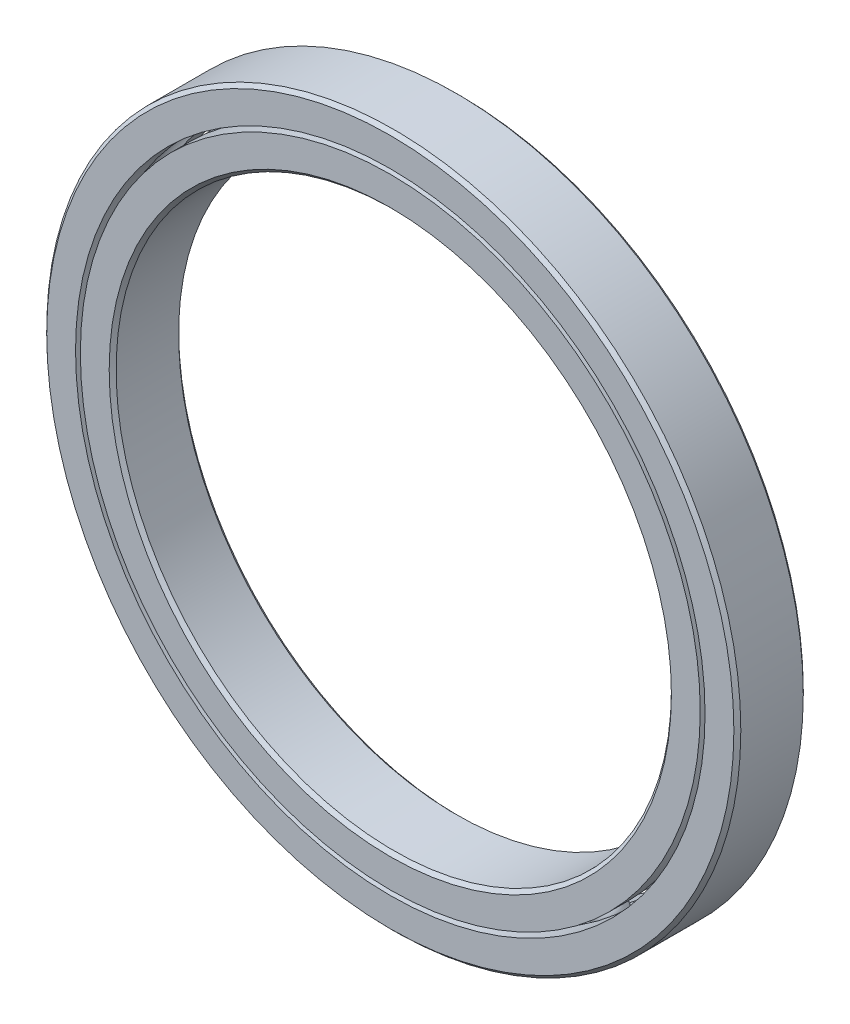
ISO-10303-21;
HEADER;
FILE_DESCRIPTION(('STEP AP214'),'2;1');
FILE_NAME('part.step','',(''),(''),'','','');
FILE_SCHEMA(('AUTOMOTIVE_DESIGN { 1 0 10303 214 1 1 1 1 }'));
ENDSEC;
DATA;
#1=APPLICATION_CONTEXT('core data for automotive mechanical design processes');
#2=APPLICATION_PROTOCOL_DEFINITION('international standard','automotive_design',2000,#1);
#3=PRODUCT_CONTEXT('',#1,'mechanical');
#4=PRODUCT('Part','Part','',(#3));
#5=PRODUCT_RELATED_PRODUCT_CATEGORY('part','',(#4));
#6=PRODUCT_DEFINITION_FORMATION('','',#4);
#7=PRODUCT_DEFINITION_CONTEXT('part definition',#1,'design');
#8=PRODUCT_DEFINITION('design','',#6,#7);
#9=PRODUCT_DEFINITION_SHAPE('','',#8);
#10=(LENGTH_UNIT() NAMED_UNIT(*) SI_UNIT(.MILLI.,.METRE.));
#11=(NAMED_UNIT(*) PLANE_ANGLE_UNIT() SI_UNIT($,.RADIAN.));
#12=(NAMED_UNIT(*) SI_UNIT($,.STERADIAN.) SOLID_ANGLE_UNIT());
#13=UNCERTAINTY_MEASURE_WITH_UNIT(LENGTH_MEASURE(1.E-05),#10,'distance_accuracy_value','');
#14=(GEOMETRIC_REPRESENTATION_CONTEXT(3) GLOBAL_UNCERTAINTY_ASSIGNED_CONTEXT((#13)) GLOBAL_UNIT_ASSIGNED_CONTEXT((#10,
#11,#12)) REPRESENTATION_CONTEXT('',''));
#15=CARTESIAN_POINT('',(0.,0.,0.));
#16=DIRECTION('',(0.,0.,1.));
#17=DIRECTION('',(1.,0.,0.));
#18=AXIS2_PLACEMENT_3D('',#15,#16,#17);
#19=CARTESIAN_POINT('',(-16.7959635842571,23.1176606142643,0.));
#20=DIRECTION('',(0.,0.,1.));
#21=DIRECTION('',(-0.587785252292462,0.809016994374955,0.));
#22=AXIS2_PLACEMENT_3D('',#19,#20,#21);
#23=SPHERICAL_SURFACE('',#22,1.42812814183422);
#24=CARTESIAN_POINT('',(-16.7959635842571,23.1176606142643,1.42812814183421));
#25=VERTEX_POINT('',#24);
#26=VERTEX_LOOP('',#25);
#27=FACE_BOUND('',#26,.T.);
#28=ADVANCED_FACE('F41',(#27),#23,.T.);
#29=CLOSED_SHELL('',(#28));
#30=MANIFOLD_SOLID_BREP('B2',#29);
#31=CARTESIAN_POINT('',(-27.1764399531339,8.83016061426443,0.));
#32=DIRECTION('',(0.,0.,1.));
#33=DIRECTION('',(-0.95105651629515,0.309016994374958,0.));
#34=AXIS2_PLACEMENT_3D('',#31,#32,#33);
#35=SPHERICAL_SURFACE('',#34,1.42812814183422);
#36=CARTESIAN_POINT('',(-27.1764399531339,8.83016061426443,1.42812814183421));
#37=VERTEX_POINT('',#36);
#38=VERTEX_LOOP('',#37);
#39=FACE_BOUND('',#38,.T.);
#40=ADVANCED_FACE('F61',(#39),#35,.T.);
#41=CLOSED_SHELL('',(#40));
#42=MANIFOLD_SOLID_BREP('B6',#41);
#43=CARTESIAN_POINT('',(-27.1764399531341,-8.83016061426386,0.));
#44=DIRECTION('',(0.,0.,1.));
#45=DIRECTION('',(-0.951056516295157,-0.309016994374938,0.));
#46=AXIS2_PLACEMENT_3D('',#43,#44,#45);
#47=SPHERICAL_SURFACE('',#46,1.42812814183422);
#48=CARTESIAN_POINT('',(-27.1764399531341,-8.83016061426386,1.42812814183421));
#49=VERTEX_POINT('',#48);
#50=VERTEX_LOOP('',#49);
#51=FACE_BOUND('',#50,.T.);
#52=ADVANCED_FACE('F81',(#51),#47,.T.);
#53=CLOSED_SHELL('',(#52));
#54=MANIFOLD_SOLID_BREP('B37',#53);
#55=CARTESIAN_POINT('',(-16.7959635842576,-23.117660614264,0.));
#56=DIRECTION('',(0.,0.,1.));
#57=DIRECTION('',(-0.58778525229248,-0.809016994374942,0.));
#58=AXIS2_PLACEMENT_3D('',#55,#56,#57);
#59=SPHERICAL_SURFACE('',#58,1.42812814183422);
#60=CARTESIAN_POINT('',(-16.7959635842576,-23.117660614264,1.42812814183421));
#61=VERTEX_POINT('',#60);
#62=VERTEX_LOOP('',#61);
#63=FACE_BOUND('',#62,.T.);
#64=ADVANCED_FACE('F101',(#63),#59,.T.);
#65=CLOSED_SHELL('',(#64));
#66=MANIFOLD_SOLID_BREP('B57',#65);
#67=CARTESIAN_POINT('',(-1.99538274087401E-13,-28.575,0.));
#68=DIRECTION('',(0.,0.,1.));
#69=DIRECTION('',(0.,-1.,0.));
#70=AXIS2_PLACEMENT_3D('',#67,#68,#69);
#71=SPHERICAL_SURFACE('',#70,1.42812814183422);
#72=CARTESIAN_POINT('',(-1.99538274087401E-13,-28.575,1.42812814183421));
#73=VERTEX_POINT('',#72);
#74=VERTEX_LOOP('',#73);
#75=FACE_BOUND('',#74,.T.);
#76=ADVANCED_FACE('F121',(#75),#71,.T.);
#77=CLOSED_SHELL('',(#76));
#78=MANIFOLD_SOLID_BREP('B77',#77);
#79=CARTESIAN_POINT('',(16.7959635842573,-23.1176606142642,0.));
#80=DIRECTION('',(0.,0.,1.));
#81=DIRECTION('',(0.587785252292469,-0.809016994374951,0.));
#82=AXIS2_PLACEMENT_3D('',#79,#80,#81);
#83=SPHERICAL_SURFACE('',#82,1.42812814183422);
#84=CARTESIAN_POINT('',(16.7959635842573,-23.1176606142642,1.42812814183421));
#85=VERTEX_POINT('',#84);
#86=VERTEX_LOOP('',#85);
#87=FACE_BOUND('',#86,.T.);
#88=ADVANCED_FACE('F141',(#87),#83,.T.);
#89=CLOSED_SHELL('',(#88));
#90=MANIFOLD_SOLID_BREP('B97',#89);
#91=CARTESIAN_POINT('',(27.176439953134,-8.83016061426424,0.));
#92=DIRECTION('',(0.,0.,1.));
#93=DIRECTION('',(0.951056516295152,-0.309016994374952,0.));
#94=AXIS2_PLACEMENT_3D('',#91,#92,#93);
#95=SPHERICAL_SURFACE('',#94,1.42812814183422);
#96=CARTESIAN_POINT('',(27.176439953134,-8.83016061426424,1.42812814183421));
#97=VERTEX_POINT('',#96);
#98=VERTEX_LOOP('',#97);
#99=FACE_BOUND('',#98,.T.);
#100=ADVANCED_FACE('F161',(#99),#95,.T.);
#101=CLOSED_SHELL('',(#100));
#102=MANIFOLD_SOLID_BREP('B117',#101);
#103=CARTESIAN_POINT('',(27.176439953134,8.83016061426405,0.));
#104=DIRECTION('',(0.,0.,1.));
#105=DIRECTION('',(0.951056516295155,0.309016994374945,0.));
#106=AXIS2_PLACEMENT_3D('',#103,#104,#105);
#107=SPHERICAL_SURFACE('',#106,1.42812814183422);
#108=CARTESIAN_POINT('',(27.176439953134,8.83016061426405,1.42812814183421));
#109=VERTEX_POINT('',#108);
#110=VERTEX_LOOP('',#109);
#111=FACE_BOUND('',#110,.T.);
#112=ADVANCED_FACE('F181',(#111),#107,.T.);
#113=CLOSED_SHELL('',(#112));
#114=MANIFOLD_SOLID_BREP('B137',#113);
#115=CARTESIAN_POINT('',(16.7959635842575,23.1176606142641,0.));
#116=DIRECTION('',(0.,0.,1.));
#117=DIRECTION('',(0.587785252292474,0.809016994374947,0.));
#118=AXIS2_PLACEMENT_3D('',#115,#116,#117);
#119=SPHERICAL_SURFACE('',#118,1.42812814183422);
#120=CARTESIAN_POINT('',(16.7959635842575,23.1176606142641,1.42812814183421));
#121=VERTEX_POINT('',#120);
#122=VERTEX_LOOP('',#121);
#123=FACE_BOUND('',#122,.T.);
#124=ADVANCED_FACE('F201',(#123),#119,.T.);
#125=CLOSED_SHELL('',(#124));
#126=MANIFOLD_SOLID_BREP('B157',#125);
#127=CARTESIAN_POINT('',(0.,28.575,0.));
#128=DIRECTION('',(0.,0.,1.));
#129=DIRECTION('',(0.,1.,0.));
#130=AXIS2_PLACEMENT_3D('',#127,#128,#129);
#131=SPHERICAL_SURFACE('',#130,1.42812814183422);
#132=CARTESIAN_POINT('',(0.,28.575,1.42812814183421));
#133=VERTEX_POINT('',#132);
#134=VERTEX_LOOP('',#133);
#135=FACE_BOUND('',#134,.T.);
#136=ADVANCED_FACE('F223',(#135),#131,.T.);
#137=CLOSED_SHELL('',(#136));
#138=MANIFOLD_SOLID_BREP('B177',#137);
#139=CARTESIAN_POINT('',(0.,28.3551923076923,3.17500000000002));
#140=DIRECTION('',(0.,0.,-1.));
#141=DIRECTION('',(-1.,0.,0.));
#142=AXIS2_PLACEMENT_3D('',#139,#140,#141);
#143=PLANE('',#142);
#144=CARTESIAN_POINT('',(0.,0.,3.17500000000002));
#145=DIRECTION('',(0.,0.,1.));
#146=DIRECTION('',(1.,0.,0.));
#147=AXIS2_PLACEMENT_3D('',#144,#145,#146);
#148=CIRCLE('',#147,25.7175);
#149=CARTESIAN_POINT('',(25.7175,0.,3.17500000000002));
#150=VERTEX_POINT('',#149);
#151=EDGE_CURVE('E278',#150,#150,#148,.T.);
#152=ORIENTED_EDGE('',*,*,#151,.F.);
#153=EDGE_LOOP('',(#152));
#154=FACE_BOUND('',#153,.T.);
#155=CARTESIAN_POINT('',(0.,0.,3.17500000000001));
#156=DIRECTION('',(0.,0.,1.));
#157=DIRECTION('',(1.,0.,0.));
#158=AXIS2_PLACEMENT_3D('',#155,#156,#157);
#159=CIRCLE('',#158,28.3551923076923);
#160=CARTESIAN_POINT('',(28.3551923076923,0.,3.17500000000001));
#161=VERTEX_POINT('',#160);
#162=EDGE_CURVE('E222',#161,#161,#159,.T.);
#163=ORIENTED_EDGE('',*,*,#162,.T.);
#164=EDGE_LOOP('',(#163));
#165=FACE_BOUND('',#164,.T.);
#166=ADVANCED_FACE('F242',(#154,#165),#143,.F.);
#167=CARTESIAN_POINT('',(0.,0.,3.175));
#168=DIRECTION('',(0.,0.,1.));
#169=DIRECTION('',(1.,0.,0.));
#170=AXIS2_PLACEMENT_3D('',#167,#168,#169);
#171=CYLINDRICAL_SURFACE('',#170,28.3551923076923);
#172=ORIENTED_EDGE('',*,*,#162,.F.);
#173=EDGE_LOOP('',(#172));
#174=FACE_BOUND('',#173,.T.);
#175=CARTESIAN_POINT('',(0.,0.,1.4111111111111));
#176=DIRECTION('',(0.,0.,1.));
#177=DIRECTION('',(1.,0.,0.));
#178=AXIS2_PLACEMENT_3D('',#175,#176,#177);
#179=CIRCLE('',#178,28.3551923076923);
#180=CARTESIAN_POINT('',(28.3551923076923,0.,1.4111111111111));
#181=VERTEX_POINT('',#180);
#182=EDGE_CURVE('E249',#181,#181,#179,.T.);
#183=ORIENTED_EDGE('',*,*,#182,.T.);
#184=EDGE_LOOP('',(#183));
#185=FACE_BOUND('',#184,.T.);
#186=ADVANCED_FACE('F285',(#174,#185),#171,.T.);
#187=CARTESIAN_POINT('',(0.,0.,0.));
#188=DIRECTION('',(0.,0.,1.));
#189=DIRECTION('',(1.,0.,0.));
#190=AXIS2_PLACEMENT_3D('',#187,#188,#189);
#191=TOROIDAL_SURFACE('',#190,28.575,1.4281281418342);
#192=ORIENTED_EDGE('',*,*,#182,.F.);
#193=EDGE_LOOP('',(#192));
#194=FACE_BOUND('',#193,.T.);
#195=CARTESIAN_POINT('',(0.,0.,-1.41111111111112));
#196=DIRECTION('',(0.,0.,1.));
#197=DIRECTION('',(1.,0.,0.));
#198=AXIS2_PLACEMENT_3D('',#195,#196,#197);
#199=CIRCLE('',#198,28.3551923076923);
#200=CARTESIAN_POINT('',(28.3551923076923,0.,-1.41111111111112));
#201=VERTEX_POINT('',#200);
#202=EDGE_CURVE('E254',#201,#201,#199,.T.);
#203=ORIENTED_EDGE('',*,*,#202,.T.);
#204=EDGE_LOOP('',(#203));
#205=FACE_BOUND('',#204,.T.);
#206=ADVANCED_FACE('F289',(#194,#205),#191,.F.);
#207=CARTESIAN_POINT('',(0.,0.,3.175));
#208=DIRECTION('',(0.,0.,1.));
#209=DIRECTION('',(1.,0.,0.));
#210=AXIS2_PLACEMENT_3D('',#207,#208,#209);
#211=CYLINDRICAL_SURFACE('',#210,28.3551923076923);
#212=ORIENTED_EDGE('',*,*,#202,.F.);
#213=EDGE_LOOP('',(#212));
#214=FACE_BOUND('',#213,.T.);
#215=CARTESIAN_POINT('',(0.,0.,-3.17500000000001));
#216=DIRECTION('',(0.,0.,1.));
#217=DIRECTION('',(1.,0.,0.));
#218=AXIS2_PLACEMENT_3D('',#215,#216,#217);
#219=CIRCLE('',#218,28.3551923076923);
#220=CARTESIAN_POINT('',(28.3551923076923,0.,-3.17500000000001));
#221=VERTEX_POINT('',#220);
#222=EDGE_CURVE('E260',#221,#221,#219,.T.);
#223=ORIENTED_EDGE('',*,*,#222,.T.);
#224=EDGE_LOOP('',(#223));
#225=FACE_BOUND('',#224,.T.);
#226=ADVANCED_FACE('F294',(#214,#225),#211,.T.);
#227=CARTESIAN_POINT('',(0.,25.7175,-3.17500000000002));
#228=DIRECTION('',(0.,0.,1.));
#229=DIRECTION('',(1.,0.,0.));
#230=AXIS2_PLACEMENT_3D('',#227,#228,#229);
#231=PLANE('',#230);
#232=ORIENTED_EDGE('',*,*,#222,.F.);
#233=EDGE_LOOP('',(#232));
#234=FACE_BOUND('',#233,.T.);
#235=CARTESIAN_POINT('',(0.,0.,-3.17500000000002));
#236=DIRECTION('',(0.,0.,1.));
#237=DIRECTION('',(1.,0.,0.));
#238=AXIS2_PLACEMENT_3D('',#235,#236,#237);
#239=CIRCLE('',#238,25.7175);
#240=CARTESIAN_POINT('',(25.7175,0.,-3.17500000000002));
#241=VERTEX_POINT('',#240);
#242=EDGE_CURVE('E266',#241,#241,#239,.T.);
#243=ORIENTED_EDGE('',*,*,#242,.T.);
#244=EDGE_LOOP('',(#243));
#245=FACE_BOUND('',#244,.T.);
#246=ADVANCED_FACE('F300',(#234,#245),#231,.F.);
#247=CARTESIAN_POINT('',(0.,0.,-2.85750000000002));
#248=DIRECTION('',(0.,0.,-1.));
#249=DIRECTION('',(-1.,0.,0.));
#250=AXIS2_PLACEMENT_3D('',#247,#248,#249);
#251=CONICAL_SURFACE('',#250,25.4,0.785398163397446);
#252=ORIENTED_EDGE('',*,*,#242,.F.);
#253=EDGE_LOOP('',(#252));
#254=FACE_BOUND('',#253,.T.);
#255=CARTESIAN_POINT('',(0.,0.,-2.85750000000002));
#256=DIRECTION('',(0.,0.,1.));
#257=DIRECTION('',(1.,0.,0.));
#258=AXIS2_PLACEMENT_3D('',#255,#256,#257);
#259=CIRCLE('',#258,25.4);
#260=CARTESIAN_POINT('',(25.4,0.,-2.85750000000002));
#261=VERTEX_POINT('',#260);
#262=EDGE_CURVE('E270',#261,#261,#259,.T.);
#263=ORIENTED_EDGE('',*,*,#262,.T.);
#264=EDGE_LOOP('',(#263));
#265=FACE_BOUND('',#264,.T.);
#266=ADVANCED_FACE('F304',(#254,#265),#251,.F.);
#267=CARTESIAN_POINT('',(0.,0.,3.175));
#268=DIRECTION('',(0.,0.,1.));
#269=DIRECTION('',(1.,0.,0.));
#270=AXIS2_PLACEMENT_3D('',#267,#268,#269);
#271=CYLINDRICAL_SURFACE('',#270,25.4);
#272=ORIENTED_EDGE('',*,*,#262,.F.);
#273=EDGE_LOOP('',(#272));
#274=FACE_BOUND('',#273,.T.);
#275=CARTESIAN_POINT('',(0.,0.,2.85750000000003));
#276=DIRECTION('',(0.,0.,1.));
#277=DIRECTION('',(1.,0.,0.));
#278=AXIS2_PLACEMENT_3D('',#275,#276,#277);
#279=CIRCLE('',#278,25.4);
#280=CARTESIAN_POINT('',(25.4,0.,2.85750000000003));
#281=VERTEX_POINT('',#280);
#282=EDGE_CURVE('E274',#281,#281,#279,.T.);
#283=ORIENTED_EDGE('',*,*,#282,.T.);
#284=EDGE_LOOP('',(#283));
#285=FACE_BOUND('',#284,.T.);
#286=ADVANCED_FACE('F308',(#274,#285),#271,.F.);
#287=CARTESIAN_POINT('',(0.,0.,3.17500000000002));
#288=DIRECTION('',(0.,0.,1.));
#289=DIRECTION('',(1.,0.,0.));
#290=AXIS2_PLACEMENT_3D('',#287,#288,#289);
#291=CONICAL_SURFACE('',#290,25.7175,0.785398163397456);
#292=ORIENTED_EDGE('',*,*,#282,.F.);
#293=EDGE_LOOP('',(#292));
#294=FACE_BOUND('',#293,.T.);
#295=ORIENTED_EDGE('',*,*,#151,.T.);
#296=EDGE_LOOP('',(#295));
#297=FACE_BOUND('',#296,.T.);
#298=ADVANCED_FACE('F282',(#294,#297),#291,.F.);
#299=CLOSED_SHELL('',(#166,#186,#206,#226,#246,#266,#286,#298));
#300=MANIFOLD_SOLID_BREP('B197',#299);
#301=CARTESIAN_POINT('',(0.,0.,2.8575));
#302=DIRECTION('',(0.,0.,-1.));
#303=DIRECTION('',(-1.,0.,0.));
#304=AXIS2_PLACEMENT_3D('',#301,#302,#303);
#305=CONICAL_SURFACE('',#304,31.75,0.785398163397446);
#306=CARTESIAN_POINT('',(0.,0.,3.175));
#307=DIRECTION('',(0.,0.,1.));
#308=DIRECTION('',(1.,0.,0.));
#309=AXIS2_PLACEMENT_3D('',#306,#307,#308);
#310=CIRCLE('',#309,31.4325);
#311=CARTESIAN_POINT('',(31.4325,0.,3.175));
#312=VERTEX_POINT('',#311);
#313=EDGE_CURVE('E409',#312,#312,#310,.T.);
#314=ORIENTED_EDGE('',*,*,#313,.F.);
#315=EDGE_LOOP('',(#314));
#316=FACE_BOUND('',#315,.T.);
#317=CARTESIAN_POINT('',(0.,0.,2.8575));
#318=DIRECTION('',(0.,0.,1.));
#319=DIRECTION('',(1.,0.,0.));
#320=AXIS2_PLACEMENT_3D('',#317,#318,#319);
#321=CIRCLE('',#320,31.75);
#322=CARTESIAN_POINT('',(31.75,0.,2.8575));
#323=VERTEX_POINT('',#322);
#324=EDGE_CURVE('E241',#323,#323,#321,.T.);
#325=ORIENTED_EDGE('',*,*,#324,.T.);
#326=EDGE_LOOP('',(#325));
#327=FACE_BOUND('',#326,.T.);
#328=ADVANCED_FACE('F373',(#316,#327),#305,.T.);
#329=CARTESIAN_POINT('',(0.,0.,3.175));
#330=DIRECTION('',(0.,0.,1.));
#331=DIRECTION('',(1.,0.,0.));
#332=AXIS2_PLACEMENT_3D('',#329,#330,#331);
#333=CYLINDRICAL_SURFACE('',#332,31.75);
#334=ORIENTED_EDGE('',*,*,#324,.F.);
#335=EDGE_LOOP('',(#334));
#336=FACE_BOUND('',#335,.T.);
#337=CARTESIAN_POINT('',(0.,0.,-2.85750000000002));
#338=DIRECTION('',(0.,0.,1.));
#339=DIRECTION('',(1.,0.,0.));
#340=AXIS2_PLACEMENT_3D('',#337,#338,#339);
#341=CIRCLE('',#340,31.75);
#342=CARTESIAN_POINT('',(31.75,0.,-2.85750000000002));
#343=VERTEX_POINT('',#342);
#344=EDGE_CURVE('E380',#343,#343,#341,.T.);
#345=ORIENTED_EDGE('',*,*,#344,.T.);
#346=EDGE_LOOP('',(#345));
#347=FACE_BOUND('',#346,.T.);
#348=ADVANCED_FACE('F416',(#336,#347),#333,.T.);
#349=CARTESIAN_POINT('',(0.,0.,-3.17500000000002));
#350=DIRECTION('',(0.,0.,1.));
#351=DIRECTION('',(1.,0.,0.));
#352=AXIS2_PLACEMENT_3D('',#349,#350,#351);
#353=CONICAL_SURFACE('',#352,31.4325,0.785398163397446);
#354=ORIENTED_EDGE('',*,*,#344,.F.);
#355=EDGE_LOOP('',(#354));
#356=FACE_BOUND('',#355,.T.);
#357=CARTESIAN_POINT('',(0.,0.,-3.17500000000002));
#358=DIRECTION('',(0.,0.,1.));
#359=DIRECTION('',(1.,0.,0.));
#360=AXIS2_PLACEMENT_3D('',#357,#358,#359);
#361=CIRCLE('',#360,31.4325);
#362=CARTESIAN_POINT('',(31.4325,0.,-3.17500000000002));
#363=VERTEX_POINT('',#362);
#364=EDGE_CURVE('E386',#363,#363,#361,.T.);
#365=ORIENTED_EDGE('',*,*,#364,.T.);
#366=EDGE_LOOP('',(#365));
#367=FACE_BOUND('',#366,.T.);
#368=ADVANCED_FACE('F420',(#356,#367),#353,.T.);
#369=CARTESIAN_POINT('',(0.,31.4325,-3.17500000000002));
#370=DIRECTION('',(0.,0.,1.));
#371=DIRECTION('',(1.,0.,0.));
#372=AXIS2_PLACEMENT_3D('',#369,#370,#371);
#373=PLANE('',#372);
#374=ORIENTED_EDGE('',*,*,#364,.F.);
#375=EDGE_LOOP('',(#374));
#376=FACE_BOUND('',#375,.T.);
#377=CARTESIAN_POINT('',(0.,0.,-3.17500000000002));
#378=DIRECTION('',(0.,0.,1.));
#379=DIRECTION('',(1.,0.,0.));
#380=AXIS2_PLACEMENT_3D('',#377,#378,#379);
#381=CIRCLE('',#380,28.7948076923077);
#382=CARTESIAN_POINT('',(28.7948076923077,0.,-3.17500000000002));
#383=VERTEX_POINT('',#382);
#384=EDGE_CURVE('E392',#383,#383,#381,.T.);
#385=ORIENTED_EDGE('',*,*,#384,.T.);
#386=EDGE_LOOP('',(#385));
#387=FACE_BOUND('',#386,.T.);
#388=ADVANCED_FACE('F425',(#376,#387),#373,.F.);
#389=CARTESIAN_POINT('',(0.,0.,3.175));
#390=DIRECTION('',(0.,0.,1.));
#391=DIRECTION('',(1.,0.,0.));
#392=AXIS2_PLACEMENT_3D('',#389,#390,#391);
#393=CYLINDRICAL_SURFACE('',#392,28.7948076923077);
#394=ORIENTED_EDGE('',*,*,#384,.F.);
#395=EDGE_LOOP('',(#394));
#396=FACE_BOUND('',#395,.T.);
#397=CARTESIAN_POINT('',(0.,0.,-1.41111111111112));
#398=DIRECTION('',(0.,0.,1.));
#399=DIRECTION('',(1.,0.,0.));
#400=AXIS2_PLACEMENT_3D('',#397,#398,#399);
#401=CIRCLE('',#400,28.7948076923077);
#402=CARTESIAN_POINT('',(28.7948076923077,0.,-1.41111111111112));
#403=VERTEX_POINT('',#402);
#404=EDGE_CURVE('E398',#403,#403,#401,.T.);
#405=ORIENTED_EDGE('',*,*,#404,.T.);
#406=EDGE_LOOP('',(#405));
#407=FACE_BOUND('',#406,.T.);
#408=ADVANCED_FACE('F431',(#396,#407),#393,.F.);
#409=CARTESIAN_POINT('',(0.,0.,0.));
#410=DIRECTION('',(0.,0.,1.));
#411=DIRECTION('',(1.,0.,0.));
#412=AXIS2_PLACEMENT_3D('',#409,#410,#411);
#413=TOROIDAL_SURFACE('',#412,28.575,1.42812814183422);
#414=ORIENTED_EDGE('',*,*,#404,.F.);
#415=EDGE_LOOP('',(#414));
#416=FACE_BOUND('',#415,.T.);
#417=CARTESIAN_POINT('',(0.,0.,1.4111111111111));
#418=DIRECTION('',(0.,0.,1.));
#419=DIRECTION('',(1.,0.,0.));
#420=AXIS2_PLACEMENT_3D('',#417,#418,#419);
#421=CIRCLE('',#420,28.7948076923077);
#422=CARTESIAN_POINT('',(28.7948076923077,0.,1.4111111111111));
#423=VERTEX_POINT('',#422);
#424=EDGE_CURVE('E402',#423,#423,#421,.T.);
#425=ORIENTED_EDGE('',*,*,#424,.T.);
#426=EDGE_LOOP('',(#425));
#427=FACE_BOUND('',#426,.T.);
#428=ADVANCED_FACE('F435',(#416,#427),#413,.F.);
#429=CARTESIAN_POINT('',(0.,0.,3.175));
#430=DIRECTION('',(0.,0.,1.));
#431=DIRECTION('',(1.,0.,0.));
#432=AXIS2_PLACEMENT_3D('',#429,#430,#431);
#433=CYLINDRICAL_SURFACE('',#432,28.7948076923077);
#434=ORIENTED_EDGE('',*,*,#424,.F.);
#435=EDGE_LOOP('',(#434));
#436=FACE_BOUND('',#435,.T.);
#437=CARTESIAN_POINT('',(0.,0.,3.175));
#438=DIRECTION('',(0.,0.,1.));
#439=DIRECTION('',(1.,0.,0.));
#440=AXIS2_PLACEMENT_3D('',#437,#438,#439);
#441=CIRCLE('',#440,28.7948076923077);
#442=CARTESIAN_POINT('',(28.7948076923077,0.,3.175));
#443=VERTEX_POINT('',#442);
#444=EDGE_CURVE('E405',#443,#443,#441,.T.);
#445=ORIENTED_EDGE('',*,*,#444,.T.);
#446=EDGE_LOOP('',(#445));
#447=FACE_BOUND('',#446,.T.);
#448=ADVANCED_FACE('F439',(#436,#447),#433,.F.);
#449=CARTESIAN_POINT('',(0.,31.4325,3.175));
#450=DIRECTION('',(0.,0.,-1.));
#451=DIRECTION('',(-1.,0.,0.));
#452=AXIS2_PLACEMENT_3D('',#449,#450,#451);
#453=PLANE('',#452);
#454=ORIENTED_EDGE('',*,*,#444,.F.);
#455=EDGE_LOOP('',(#454));
#456=FACE_BOUND('',#455,.T.);
#457=ORIENTED_EDGE('',*,*,#313,.T.);
#458=EDGE_LOOP('',(#457));
#459=FACE_BOUND('',#458,.T.);
#460=ADVANCED_FACE('F413',(#456,#459),#453,.F.);
#461=CLOSED_SHELL('',(#328,#348,#368,#388,#408,#428,#448,#460));
#462=MANIFOLD_SOLID_BREP('B217',#461);
#463=ADVANCED_BREP_SHAPE_REPRESENTATION('',(#18,#30,#42,#54,#66,#78,#90,#102,#114,#126,#138,
#300,#462),#14);
#464=SHAPE_DEFINITION_REPRESENTATION(#9,#463);
ENDSEC;
END-ISO-10303-21;
